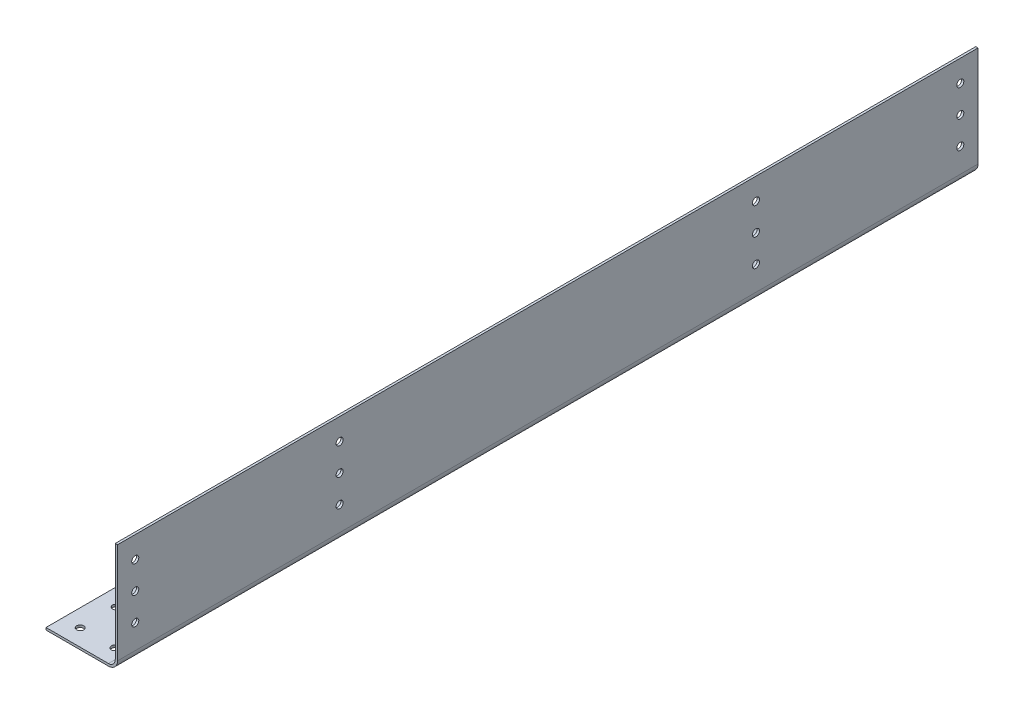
from build123d import *

# Parameters (mm, degrees)
BOSS_EXTRUDE1_DEPTH    = 597.69375
SKETCH4_R              = 4.9022
F_47IN_PNL_HOLES_DEPTH = 25.4
SKETCH5_R              = 4.9022
OUTERSIDE_HOLES_DEPTH  = 76.2
SKETCH8_R              = 4.9022
CUT_EXTRUDE4_DEPTH     = 76.2


with BuildPart() as part:
    # Sketch3 → Boss-Extrude1 (new, symmetric)
    with BuildSketch(Plane.XY):
        with BuildLine():
            Line((-48.26, 3.175), (38.4302, 3.175))
            ThreePointArc((38.4302, 3.175), (45.165392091, 5.964807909), (47.9552, 12.7))
            Line((47.9552, 12.7), (47.9552, 152.4))
            Line((47.9552, 152.4), (51.1302, 152.4))
            Line((51.1302, 152.4), (51.1302, 12.7))
            ThreePointArc((51.1302, 12.7), (47.410456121, 3.719743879), (38.4302, 0))
            Line((38.4302, 0), (-48.26, 0))
            Line((-48.26, 0), (-48.26, 3.175))
        make_face()
    extrude(amount=BOSS_EXTRUDE1_DEPTH, both=True)

    # Sketch4 → 47in pnl holes (cut)
    with BuildSketch(Plane(origin=(0, 0, 0), x_dir=(1, 0, 0), z_dir=(0, 1, 0))):
        with Locations(Location((-24.13, -574.3575, 0), (0, 0, 90))):
            Circle(SKETCH4_R)
        with Locations(Location((24.13, -574.3575, 0), (0, 0, 90))):
            Circle(SKETCH4_R)
        with Locations(Location((-24.13, -524.413369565, 0), (0, 0, 90))):
            Circle(SKETCH4_R)
        with Locations(Location((24.13, -524.413369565, 0), (0, 0, 90))):
            Circle(SKETCH4_R)
        with Locations(Location((-24.13, -474.46923913, 0), (0, 0, 90))):
            Circle(SKETCH4_R)
        with Locations(Location((24.13, -474.46923913, 0), (0, 0, 90))):
            Circle(SKETCH4_R)
        with Locations(Location((-24.13, -424.525108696, 0), (0, 0, 90))):
            Circle(SKETCH4_R)
        with Locations(Location((24.13, -424.525108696, 0), (0, 0, 90))):
            Circle(SKETCH4_R)
        with Locations(Location((-24.13, -374.580978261, 0), (0, 0, 90))):
            Circle(SKETCH4_R)
        with Locations(Location((24.13, -374.580978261, 0), (0, 0, 90))):
            Circle(SKETCH4_R)
        with Locations(Location((-24.13, -324.636847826, 0), (0, 0, 90))):
            Circle(SKETCH4_R)
        with Locations(Location((24.13, -324.636847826, 0), (0, 0, 90))):
            Circle(SKETCH4_R)
        with Locations(Location((-24.13, -274.692717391, 0), (0, 0, 90))):
            Circle(SKETCH4_R)
        with Locations(Location((24.13, -274.692717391, 0), (0, 0, 90))):
            Circle(SKETCH4_R)
        with Locations(Location((-24.13, -224.748586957, 0), (0, 0, 90))):
            Circle(SKETCH4_R)
        with Locations(Location((24.13, -224.748586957, 0), (0, 0, 90))):
            Circle(SKETCH4_R)
        with Locations(Location((-24.13, -174.804456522, 0), (0, 0, 90))):
            Circle(SKETCH4_R)
        with Locations(Location((24.13, -174.804456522, 0), (0, 0, 90))):
            Circle(SKETCH4_R)
        with Locations(Location((-24.13, -124.860326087, 0), (0, 0, 90))):
            Circle(SKETCH4_R)
        with Locations(Location((24.13, -124.860326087, 0), (0, 0, 90))):
            Circle(SKETCH4_R)
        with Locations(Location((-24.13, -74.916195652, 0), (0, 0, 90))):
            Circle(SKETCH4_R)
        with Locations(Location((24.13, -74.916195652, 0), (0, 0, 90))):
            Circle(SKETCH4_R)
        with Locations(Location((-24.13, -24.972065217, 0), (0, 0, 90))):
            Circle(SKETCH4_R)
        with Locations(Location((24.13, -24.972065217, 0), (0, 0, 90))):
            Circle(SKETCH4_R)
        with Locations(Location((-24.13, 24.972065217, 0), (0, 0, 90))):
            Circle(SKETCH4_R)
        with Locations(Location((24.13, 24.972065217, 0), (0, 0, 90))):
            Circle(SKETCH4_R)
        with Locations(Location((-24.13, 74.916195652, 0), (0, 0, 90))):
            Circle(SKETCH4_R)
        with Locations(Location((24.13, 74.916195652, 0), (0, 0, 90))):
            Circle(SKETCH4_R)
        with Locations(Location((-24.13, 124.860326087, 0), (0, 0, 90))):
            Circle(SKETCH4_R)
        with Locations(Location((24.13, 124.860326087, 0), (0, 0, 90))):
            Circle(SKETCH4_R)
        with Locations(Location((-24.13, 174.804456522, 0), (0, 0, 90))):
            Circle(SKETCH4_R)
        with Locations(Location((24.13, 174.804456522, 0), (0, 0, 90))):
            Circle(SKETCH4_R)
        with Locations(Location((-24.13, 224.748586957, 0), (0, 0, 90))):
            Circle(SKETCH4_R)
        with Locations(Location((24.13, 224.748586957, 0), (0, 0, 90))):
            Circle(SKETCH4_R)
        with Locations(Location((-24.13, 274.692717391, 0), (0, 0, 90))):
            Circle(SKETCH4_R)
        with Locations(Location((24.13, 274.692717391, 0), (0, 0, 90))):
            Circle(SKETCH4_R)
        with Locations(Location((-24.13, 324.636847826, 0), (0, 0, 90))):
            Circle(SKETCH4_R)
        with Locations(Location((24.13, 324.636847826, 0), (0, 0, 90))):
            Circle(SKETCH4_R)
        with Locations(Location((-24.13, 374.580978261, 0), (0, 0, 90))):
            Circle(SKETCH4_R)
        with Locations(Location((24.13, 374.580978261, 0), (0, 0, 90))):
            Circle(SKETCH4_R)
        with Locations(Location((-24.13, 424.525108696, 0), (0, 0, 90))):
            Circle(SKETCH4_R)
        with Locations(Location((24.13, 424.525108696, 0), (0, 0, 90))):
            Circle(SKETCH4_R)
        with Locations(Location((-24.13, 474.46923913, 0), (0, 0, 90))):
            Circle(SKETCH4_R)
        with Locations(Location((24.13, 474.46923913, 0), (0, 0, 90))):
            Circle(SKETCH4_R)
        with Locations(Location((-24.13, 524.413369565, 0), (0, 0, 90))):
            Circle(SKETCH4_R)
        with Locations(Location((24.13, 524.413369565, 0), (0, 0, 90))):
            Circle(SKETCH4_R)
        with Locations(Location((-24.13, 574.3575, 0), (0, 0, 90))):
            Circle(SKETCH4_R)
        with Locations(Location((24.13, 574.3575, 0), (0, 0, 90))):
            Circle(SKETCH4_R)
    extrude(amount=F_47IN_PNL_HOLES_DEPTH, mode=Mode.SUBTRACT)

    # Sketch5 → Outerside holes (cut)
    with BuildSketch(Plane(origin=(0, 0, 0), x_dir=(0, 0, -1), z_dir=(1, 0, 0))):
        with Locations(Location((-573.0875, 46.355, 0), (0, 0, 180))):
            Circle(SKETCH5_R)
        with Locations(Location((573.0875, 46.355, 0), (0, 0, 180))):
            Circle(SKETCH5_R)
        with Locations(Location((-573.0875, 84.254473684, 0), (0, 0, 180))):
            Circle(SKETCH5_R)
        with Locations(Location((573.0875, 84.254473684, 0), (0, 0, 180))):
            Circle(SKETCH5_R)
        with Locations(Location((-573.0875, 122.153947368, 0), (0, 0, 180))):
            Circle(SKETCH5_R)
        with Locations(Location((573.0875, 122.153947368, 0), (0, 0, 180))):
            Circle(SKETCH5_R)
    extrude(amount=OUTERSIDE_HOLES_DEPTH, mode=Mode.SUBTRACT)

    # Sketch8 → Cut-Extrude4 (cut)
    with BuildSketch(Plane(origin=(0, 0, 0), x_dir=(0, 0, -1), z_dir=(1, 0, 0))):
        with Locations(Location((-289.199113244, 46.355, 0), (0, 0, 180))):
            Circle(SKETCH8_R)
        with Locations(Location((-289.199113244, 84.254473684, 0), (0, 0, 180))):
            Circle(SKETCH8_R)
        with Locations(Location((-289.199113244, 122.153947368, 0), (0, 0, 180))):
            Circle(SKETCH8_R)
        with Locations(Location((289.199113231, 46.355, 0), (0, 0, 180))):
            Circle(SKETCH8_R)
        with Locations(Location((289.199113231, 84.254473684, 0), (0, 0, 180))):
            Circle(SKETCH8_R)
        with Locations(Location((289.199113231, 122.153947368, 0), (0, 0, 180))):
            Circle(SKETCH8_R)
    extrude(amount=CUT_EXTRUDE4_DEPTH, mode=Mode.SUBTRACT)


solid = part.part
